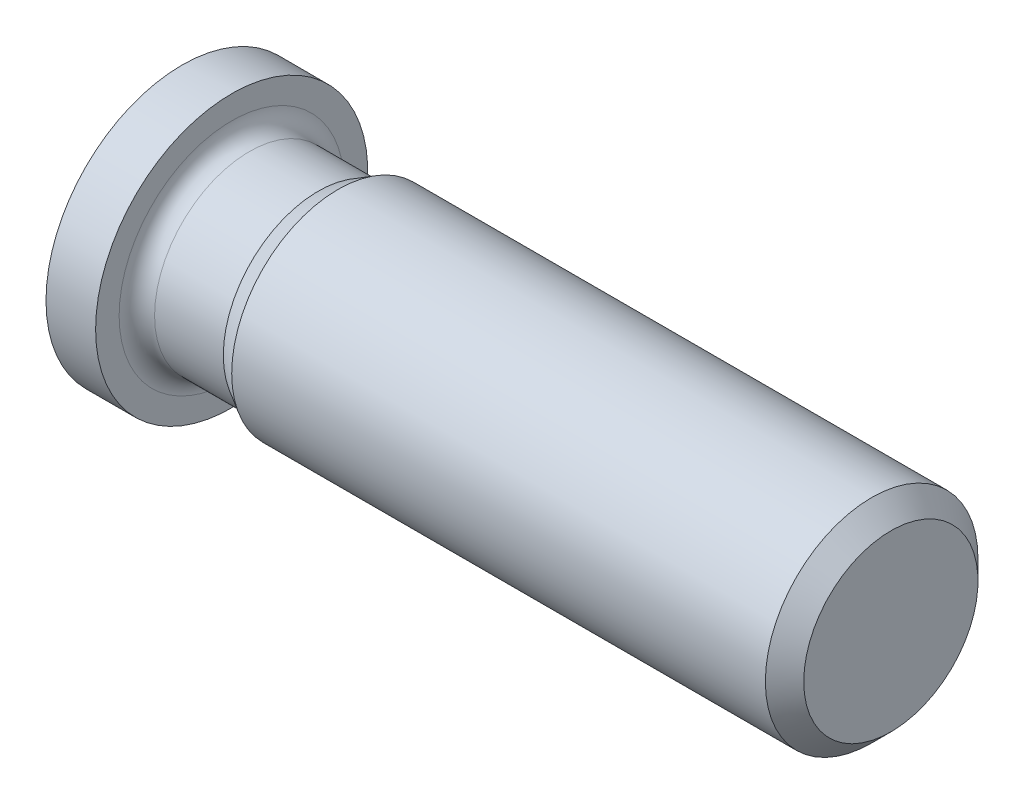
from build123d import *

# Parameters (mm, degrees)
ENDCHAMFER_SIZE = 0.5415


with BuildPart() as part:
    # Sketch1 → Base (revolve)
    with BuildSketch(Plane.XY, mode=Mode.PRIVATE) as base_sk:
        with BuildLine():
            Line((0, 0), (0, 0.44))
            Line((0, 0.44), (0.83, 0.919200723))
            Line((0.83, 0.919200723), (1.136988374, 3.84))
            Line((1.136988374, 3.84), (2.536988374, 3.84))
            Line((2.536988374, 3.84), (2.536988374, 3.1765))
            ThreePointArc((2.536988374, 3.1765), (2.683434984, 2.822946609), (3.036988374, 2.6765))
            Line((3.036988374, 2.6765), (4.976669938, 2.6765))
            Line((4.976669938, 2.6765), (5.536988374, 3))
            Line((5.536988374, 3), (21.136988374, 3))
            Line((21.136988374, 3), (21.136988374, 0))
            Line((21.136988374, 0), (0, 0))
        make_face()
    revolve(base_sk.sketch.rotate(Axis((0, 0, 0), (1, 0, 0)), 90), axis=Axis((0, 0, 0), (1, 0, 0)))

    # EndChamfer
    endchamfer_edges = [part.edges().sort_by_distance(p)[0] for p in [
        (21.136988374, 0, -3),
    ]]
    chamfer(endchamfer_edges, length=ENDCHAMFER_SIZE)


solid = part.part
